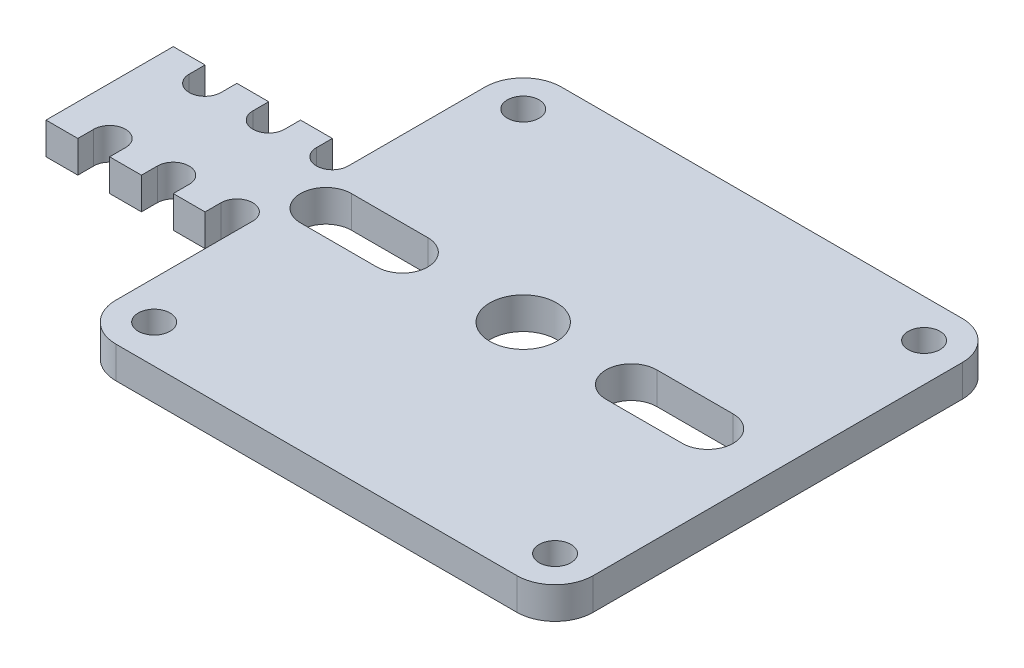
from build123d import *

# Parameters (mm, degrees)
SKETCH1_R      = 2.5
SKETCH1_R_2    = 5.25
EXTRUDE1_DEPTH = 5


with BuildPart() as part:
    # Sketch1 → Extrude1 (new body)
    with BuildSketch(Plane(origin=(0, 0, 0), x_dir=(1, 0, 0), z_dir=(0, 1, 0))):
        with BuildLine():
            Line((30, 6), (30, 27.5))
            ThreePointArc((30, 27.5), (27.5, 30), (25, 27.5))
            Line((25, 27.5), (25, 25))
            Line((25, 25), (20, 25))
            Line((20, 25), (20, 27.5))
            ThreePointArc((20, 27.5), (17.5, 30), (15, 27.5))
            Line((15, 27.5), (15, 25))
            Line((15, 25), (10, 25))
            Line((10, 25), (10, 27.5))
            ThreePointArc((10, 27.5), (7.5, 30), (5, 27.5))
            Line((5, 27.5), (5, 25))
            Line((5, 25), (0, 25))
            Line((0, 25), (0, 45))
            Line((0, 45), (5, 45))
            Line((5, 45), (5, 42.5))
            ThreePointArc((5, 42.5), (7.5, 40), (10, 42.5))
            Line((10, 42.5), (10, 45))
            Line((10, 45), (15, 45))
            Line((15, 45), (15, 42.5))
            ThreePointArc((15, 42.5), (17.5, 40), (20, 42.5))
            Line((20, 42.5), (20, 45))
            Line((20, 45), (25, 45))
            Line((25, 45), (25, 42.5))
            ThreePointArc((25, 42.5), (27.5, 40), (30, 42.5))
            Line((30, 42.5), (30, 64))
            ThreePointArc((30, 64), (31.757359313, 68.242640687), (36, 70))
            Line((36, 70), (99, 70))
            ThreePointArc((99, 70), (103.242640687, 68.242640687), (105, 64))
            Line((105, 64), (105, 6))
            ThreePointArc((105, 6), (103.242640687, 1.757359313), (99, 0))
            Line((99, 0), (36, 0))
            ThreePointArc((36, 0), (31.757359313, 1.757359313), (30, 6))
        make_face()
        with Locations(Location((36, 64, 0), (0, 0, 270))):
            Circle(SKETCH1_R, mode=Mode.SUBTRACT)
        with Locations(Location((99, 64, 0), (0, 0, 270))):
            Circle(SKETCH1_R, mode=Mode.SUBTRACT)
        with Locations(Location((99, 6, 0), (0, 0, 270))):
            Circle(SKETCH1_R, mode=Mode.SUBTRACT)
        with Locations(Location((36, 6, 0), (0, 0, 270))):
            Circle(SKETCH1_R, mode=Mode.SUBTRACT)
        with Locations(Location((65, 35, 0), (0, 0, 270))):
            Circle(SKETCH1_R_2, mode=Mode.SUBTRACT)
        with BuildLine():
            Line((34, 31), (46, 31))
            ThreePointArc((46, 31), (50, 35), (46, 39))
            Line((46, 39), (34, 39))
            ThreePointArc((34, 39), (30, 35), (34, 31))
        make_face(mode=Mode.SUBTRACT)
        with BuildLine():
            Line((82, 31), (94, 31))
            ThreePointArc((94, 31), (98, 35), (94, 39))
            Line((94, 39), (82, 39))
            ThreePointArc((82, 39), (78, 35), (82, 31))
        make_face(mode=Mode.SUBTRACT)
    extrude(amount=EXTRUDE1_DEPTH)


solid = part.part
